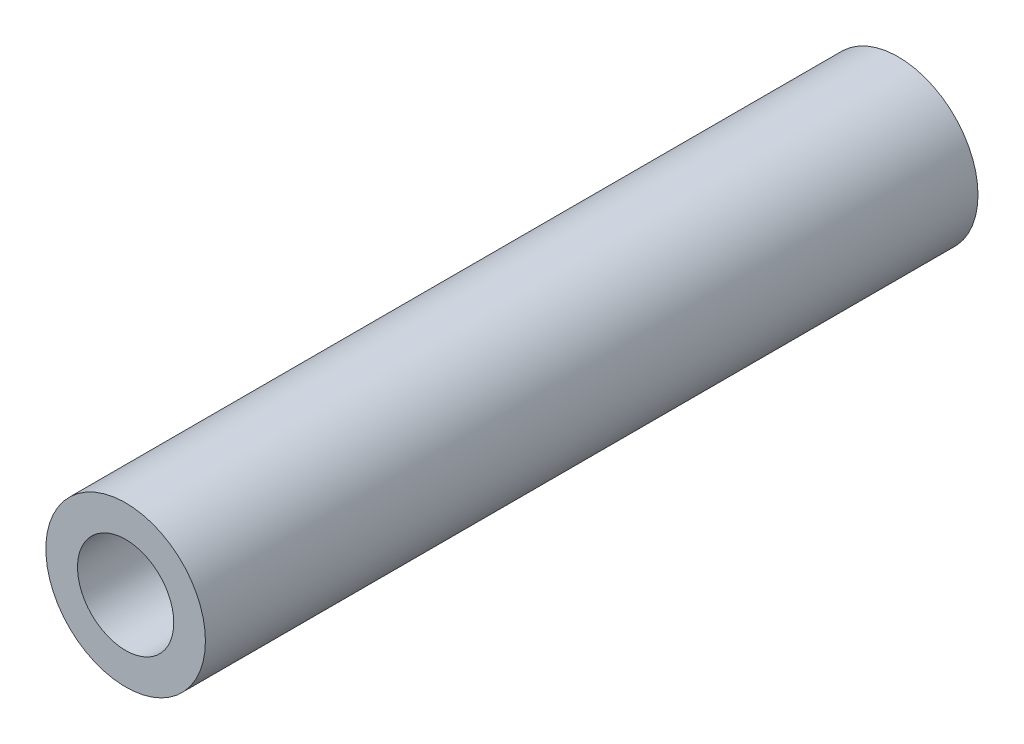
ISO-10303-21;
HEADER;
FILE_DESCRIPTION(('STEP AP214'),'2;1');
FILE_NAME('part.step','',(''),(''),'','','');
FILE_SCHEMA(('AUTOMOTIVE_DESIGN { 1 0 10303 214 1 1 1 1 }'));
ENDSEC;
DATA;
#1=APPLICATION_CONTEXT('core data for automotive mechanical design processes');
#2=APPLICATION_PROTOCOL_DEFINITION('international standard','automotive_design',2000,#1);
#3=PRODUCT_CONTEXT('',#1,'mechanical');
#4=PRODUCT('Part','Part','',(#3));
#5=PRODUCT_RELATED_PRODUCT_CATEGORY('part','',(#4));
#6=PRODUCT_DEFINITION_FORMATION('','',#4);
#7=PRODUCT_DEFINITION_CONTEXT('part definition',#1,'design');
#8=PRODUCT_DEFINITION('design','',#6,#7);
#9=PRODUCT_DEFINITION_SHAPE('','',#8);
#10=(LENGTH_UNIT() NAMED_UNIT(*) SI_UNIT(.MILLI.,.METRE.));
#11=(NAMED_UNIT(*) PLANE_ANGLE_UNIT() SI_UNIT($,.RADIAN.));
#12=(NAMED_UNIT(*) SI_UNIT($,.STERADIAN.) SOLID_ANGLE_UNIT());
#13=UNCERTAINTY_MEASURE_WITH_UNIT(LENGTH_MEASURE(1.E-05),#10,'distance_accuracy_value','');
#14=(GEOMETRIC_REPRESENTATION_CONTEXT(3) GLOBAL_UNCERTAINTY_ASSIGNED_CONTEXT((#13)) GLOBAL_UNIT_ASSIGNED_CONTEXT((#10,
#11,#12)) REPRESENTATION_CONTEXT('',''));
#15=CARTESIAN_POINT('',(0.,0.,0.));
#16=DIRECTION('',(0.,0.,1.));
#17=DIRECTION('',(1.,0.,0.));
#18=AXIS2_PLACEMENT_3D('',#15,#16,#17);
#19=CARTESIAN_POINT('',(0.,0.,305.));
#20=DIRECTION('',(0.,0.,1.));
#21=DIRECTION('',(1.,0.,0.));
#22=AXIS2_PLACEMENT_3D('',#19,#20,#21);
#23=PLANE('',#22);
#24=CARTESIAN_POINT('',(0.,0.,305.));
#25=DIRECTION('',(0.,0.,1.));
#26=DIRECTION('',(1.,0.,0.));
#27=AXIS2_PLACEMENT_3D('',#24,#25,#26);
#28=CIRCLE('',#27,31.5);
#29=CARTESIAN_POINT('',(31.5,0.,305.));
#30=VERTEX_POINT('',#29);
#31=EDGE_CURVE('E9',#30,#30,#28,.T.);
#32=ORIENTED_EDGE('',*,*,#31,.T.);
#33=EDGE_LOOP('',(#32));
#34=FACE_BOUND('',#33,.T.);
#35=CARTESIAN_POINT('',(0.,0.,305.));
#36=DIRECTION('',(0.,0.,1.));
#37=DIRECTION('',(1.,0.,0.));
#38=AXIS2_PLACEMENT_3D('',#35,#36,#37);
#39=CIRCLE('',#38,19.);
#40=CARTESIAN_POINT('',(19.,0.,305.));
#41=VERTEX_POINT('',#40);
#42=EDGE_CURVE('E25',#41,#41,#39,.T.);
#43=ORIENTED_EDGE('',*,*,#42,.F.);
#44=EDGE_LOOP('',(#43));
#45=FACE_BOUND('',#44,.T.);
#46=ADVANCED_FACE('F14',(#34,#45),#23,.T.);
#47=CARTESIAN_POINT('',(0.,0.,0.));
#48=DIRECTION('',(0.,0.,1.));
#49=DIRECTION('',(1.,0.,0.));
#50=AXIS2_PLACEMENT_3D('',#47,#48,#49);
#51=PLANE('',#50);
#52=CARTESIAN_POINT('',(0.,0.,0.));
#53=DIRECTION('',(0.,0.,1.));
#54=DIRECTION('',(1.,0.,0.));
#55=AXIS2_PLACEMENT_3D('',#52,#53,#54);
#56=CIRCLE('',#55,31.5);
#57=CARTESIAN_POINT('',(31.5,0.,0.));
#58=VERTEX_POINT('',#57);
#59=EDGE_CURVE('E18',#58,#58,#56,.T.);
#60=ORIENTED_EDGE('',*,*,#59,.F.);
#61=EDGE_LOOP('',(#60));
#62=FACE_BOUND('',#61,.T.);
#63=CARTESIAN_POINT('',(0.,0.,0.));
#64=DIRECTION('',(0.,0.,1.));
#65=DIRECTION('',(1.,0.,0.));
#66=AXIS2_PLACEMENT_3D('',#63,#64,#65);
#67=CIRCLE('',#66,19.);
#68=CARTESIAN_POINT('',(19.,0.,0.));
#69=VERTEX_POINT('',#68);
#70=EDGE_CURVE('E27',#69,#69,#67,.T.);
#71=ORIENTED_EDGE('',*,*,#70,.T.);
#72=EDGE_LOOP('',(#71));
#73=FACE_BOUND('',#72,.T.);
#74=ADVANCED_FACE('F37',(#62,#73),#51,.F.);
#75=CARTESIAN_POINT('',(0.,0.,305.));
#76=DIRECTION('',(0.,0.,-1.));
#77=DIRECTION('',(-1.,0.,0.));
#78=AXIS2_PLACEMENT_3D('',#75,#76,#77);
#79=CYLINDRICAL_SURFACE('',#78,31.5);
#80=ORIENTED_EDGE('',*,*,#31,.F.);
#81=EDGE_LOOP('',(#80));
#82=FACE_BOUND('',#81,.T.);
#83=ORIENTED_EDGE('',*,*,#59,.T.);
#84=EDGE_LOOP('',(#83));
#85=FACE_BOUND('',#84,.T.);
#86=ADVANCED_FACE('F16',(#82,#85),#79,.T.);
#87=CARTESIAN_POINT('',(0.,0.,305.));
#88=DIRECTION('',(0.,0.,-1.));
#89=DIRECTION('',(-1.,0.,0.));
#90=AXIS2_PLACEMENT_3D('',#87,#88,#89);
#91=CYLINDRICAL_SURFACE('',#90,19.);
#92=ORIENTED_EDGE('',*,*,#42,.T.);
#93=EDGE_LOOP('',(#92));
#94=FACE_BOUND('',#93,.T.);
#95=ORIENTED_EDGE('',*,*,#70,.F.);
#96=EDGE_LOOP('',(#95));
#97=FACE_BOUND('',#96,.T.);
#98=ADVANCED_FACE('F33',(#94,#97),#91,.F.);
#99=CLOSED_SHELL('',(#46,#74,#86,#98));
#100=MANIFOLD_SOLID_BREP('B1',#99);
#101=ADVANCED_BREP_SHAPE_REPRESENTATION('',(#18,#100),#14);
#102=SHAPE_DEFINITION_REPRESENTATION(#9,#101);
ENDSEC;
END-ISO-10303-21;
